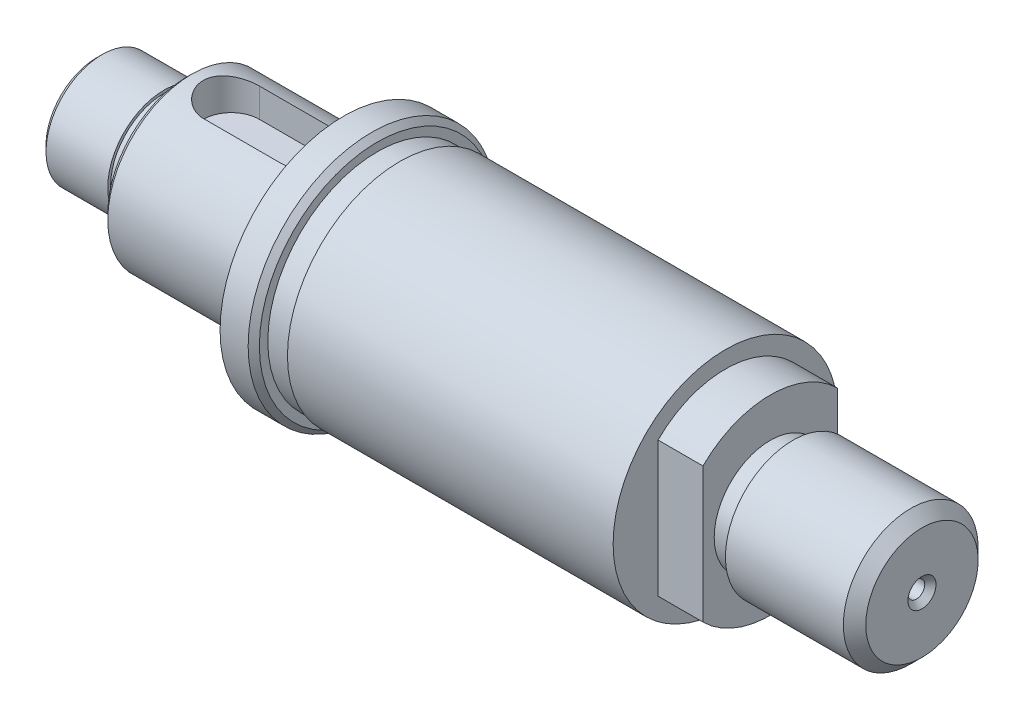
ISO-10303-21;
HEADER;
FILE_DESCRIPTION(('STEP AP214'),'2;1');
FILE_NAME('part.step','',(''),(''),'','','');
FILE_SCHEMA(('AUTOMOTIVE_DESIGN { 1 0 10303 214 1 1 1 1 }'));
ENDSEC;
DATA;
#1=APPLICATION_CONTEXT('core data for automotive mechanical design processes');
#2=APPLICATION_PROTOCOL_DEFINITION('international standard','automotive_design',2000,#1);
#3=PRODUCT_CONTEXT('',#1,'mechanical');
#4=PRODUCT('Part','Part','',(#3));
#5=PRODUCT_RELATED_PRODUCT_CATEGORY('part','',(#4));
#6=PRODUCT_DEFINITION_FORMATION('','',#4);
#7=PRODUCT_DEFINITION_CONTEXT('part definition',#1,'design');
#8=PRODUCT_DEFINITION('design','',#6,#7);
#9=PRODUCT_DEFINITION_SHAPE('','',#8);
#10=(LENGTH_UNIT() NAMED_UNIT(*) SI_UNIT(.MILLI.,.METRE.));
#11=(NAMED_UNIT(*) PLANE_ANGLE_UNIT() SI_UNIT($,.RADIAN.));
#12=(NAMED_UNIT(*) SI_UNIT($,.STERADIAN.) SOLID_ANGLE_UNIT());
#13=UNCERTAINTY_MEASURE_WITH_UNIT(LENGTH_MEASURE(1.E-05),#10,'distance_accuracy_value','');
#14=(GEOMETRIC_REPRESENTATION_CONTEXT(3) GLOBAL_UNCERTAINTY_ASSIGNED_CONTEXT((#13)) GLOBAL_UNIT_ASSIGNED_CONTEXT((#10,
#11,#12)) REPRESENTATION_CONTEXT('',''));
#15=CARTESIAN_POINT('',(0.,0.,0.));
#16=DIRECTION('',(0.,0.,1.));
#17=DIRECTION('',(1.,0.,0.));
#18=AXIS2_PLACEMENT_3D('',#15,#16,#17);
#19=CARTESIAN_POINT('',(0.,0.,0.));
#20=DIRECTION('',(-1.,0.,0.));
#21=DIRECTION('',(0.,0.,1.));
#22=AXIS2_PLACEMENT_3D('',#19,#20,#21);
#23=CYLINDRICAL_SURFACE('',#22,7.5);
#24=CARTESIAN_POINT('',(22.,0.,0.));
#25=DIRECTION('',(-1.,0.,0.));
#26=DIRECTION('',(0.,0.,1.));
#27=AXIS2_PLACEMENT_3D('',#24,#25,#26);
#28=CIRCLE('',#27,7.5);
#29=CARTESIAN_POINT('',(22.,0.,7.5));
#30=VERTEX_POINT('',#29);
#31=EDGE_CURVE('E198',#30,#30,#28,.T.);
#32=ORIENTED_EDGE('',*,*,#31,.T.);
#33=EDGE_LOOP('',(#32));
#34=FACE_BOUND('',#33,.T.);
#35=CARTESIAN_POINT('',(8.49999999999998,0.,0.));
#36=DIRECTION('',(1.,0.,0.));
#37=DIRECTION('',(0.,0.,-1.));
#38=AXIS2_PLACEMENT_3D('',#35,#36,#37);
#39=CIRCLE('',#38,7.5);
#40=CARTESIAN_POINT('',(8.49999999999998,0.,-7.5));
#41=VERTEX_POINT('',#40);
#42=EDGE_CURVE('E213',#41,#41,#39,.T.);
#43=ORIENTED_EDGE('',*,*,#42,.T.);
#44=EDGE_LOOP('',(#43));
#45=FACE_BOUND('',#44,.T.);
#46=CARTESIAN_POINT('',(19.,7.07106781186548,2.5));
#47=CARTESIAN_POINT('',(19.0682070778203,7.07105693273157,2.50000899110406));
#48=CARTESIAN_POINT('',(19.1364080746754,7.07205443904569,2.49720887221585));
#49=CARTESIAN_POINT('',(19.2722810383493,7.07598524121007,2.4860604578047));
#50=CARTESIAN_POINT('',(19.3399531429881,7.07891801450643,2.47771365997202));
#51=CARTESIAN_POINT('',(19.4740904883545,7.08662705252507,2.45557459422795));
#52=CARTESIAN_POINT('',(19.5405587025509,7.09139784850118,2.44179847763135));
#53=CARTESIAN_POINT('',(19.6720082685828,7.10262619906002,2.4089418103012));
#54=CARTESIAN_POINT('',(19.7369895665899,7.10908381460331,2.38986106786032));
#55=CARTESIAN_POINT('',(19.9289615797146,7.13069940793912,2.32491551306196));
#56=CARTESIAN_POINT('',(20.05317915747,7.14811243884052,2.2713141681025));
#57=CARTESIAN_POINT('',(20.2908768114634,7.1869703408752,2.14517784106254));
#58=CARTESIAN_POINT('',(20.4043502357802,7.20841768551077,2.07263123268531));
#59=CARTESIAN_POINT('',(20.6217929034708,7.25386182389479,1.90762995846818));
#60=CARTESIAN_POINT('',(20.7252851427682,7.27792189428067,1.81456284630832));
#61=CARTESIAN_POINT('',(20.9155171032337,7.32534626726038,1.61247071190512));
#62=CARTESIAN_POINT('',(21.002253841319,7.34871044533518,1.50344285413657));
#63=CARTESIAN_POINT('',(21.1586982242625,7.39284706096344,1.26900922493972));
#64=CARTESIAN_POINT('',(21.2279023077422,7.41353593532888,1.1432502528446));
#65=CARTESIAN_POINT('',(21.3439807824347,7.44924021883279,0.881073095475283));
#66=CARTESIAN_POINT('',(21.3908619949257,7.46425736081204,0.744658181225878));
#67=CARTESIAN_POINT('',(21.4593392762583,7.48647677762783,0.470073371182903));
#68=CARTESIAN_POINT('',(21.4817581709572,7.49393272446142,0.332129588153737));
#69=CARTESIAN_POINT('',(21.5032907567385,7.50109021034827,0.0542474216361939));
#70=CARTESIAN_POINT('',(21.5024100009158,7.50079359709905,-0.0856904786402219));
#71=CARTESIAN_POINT('',(21.4778892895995,7.49265096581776,-0.35775961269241));
#72=CARTESIAN_POINT('',(21.4551434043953,7.48510152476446,-0.489981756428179));
#73=CARTESIAN_POINT('',(21.3890170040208,7.46367401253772,-0.748610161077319));
#74=CARTESIAN_POINT('',(21.3456353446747,7.44979559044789,-0.875016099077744));
#75=CARTESIAN_POINT('',(21.2389465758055,7.41689170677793,-1.12038155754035));
#76=CARTESIAN_POINT('',(21.1753848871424,7.39780094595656,-1.23922126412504));
#77=CARTESIAN_POINT('',(21.030350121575,7.35645969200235,-1.46481147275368));
#78=CARTESIAN_POINT('',(20.9488721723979,7.33420833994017,-1.57155867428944));
#79=CARTESIAN_POINT('',(20.765822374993,7.28765679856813,-1.77524334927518));
#80=CARTESIAN_POINT('',(20.6634861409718,7.26330946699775,-1.87148402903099));
#81=CARTESIAN_POINT('',(20.4438962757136,7.21618726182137,-2.04568006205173));
#82=CARTESIAN_POINT('',(20.326637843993,7.19341289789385,-2.12362950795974));
#83=CARTESIAN_POINT('',(20.0782995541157,7.15175078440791,-2.26000831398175));
#84=CARTESIAN_POINT('',(19.9470412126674,7.13292537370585,-2.31813252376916));
#85=CARTESIAN_POINT('',(19.6758825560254,7.10202742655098,-2.41115057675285));
#86=CARTESIAN_POINT('',(19.5359962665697,7.08994423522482,-2.44608109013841));
#87=CARTESIAN_POINT('',(19.32895340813,7.078413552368,-2.47914539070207));
#88=CARTESIAN_POINT('',(19.2633965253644,7.07566669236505,-2.48696265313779));
#89=CARTESIAN_POINT('',(19.1319048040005,7.07199258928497,-2.497386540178));
#90=CARTESIAN_POINT('',(19.065970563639,7.0710629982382,-2.49999988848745));
#91=CARTESIAN_POINT('',(19.,7.07106781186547,-2.5));
#92=B_SPLINE_CURVE_WITH_KNOTS('',3,(#46,#47,#48,#49,#50,#51,#52,#53,#54,#55,#56,#57,#58,#59,#60,
#61,#62,#63,#64,#65,#66,#67,#68,#69,#70,#71,#72,#73,#74,#75,#76,#77,#78,#79,#80,#81,#82,#83,#84,
#85,#86,#87,#88,#89,#90,#91),.UNSPECIFIED.,.F.,.F.,(4,2,2,2,2,2,2,2,2,2,2,2,2,2,2,2,2,2,2,2,2,2,
4),(0.,0.204546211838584,0.409037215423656,0.612924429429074,0.816819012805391,1.22401016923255,
1.63145179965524,2.0532786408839,2.47518051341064,2.90809434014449,3.34087579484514,
3.75860278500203,4.17623021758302,4.57747647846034,4.97874498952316,5.38529148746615,
5.79194868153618,6.21771736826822,6.64362337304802,7.07581676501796,7.50732520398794,
7.70536340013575,7.90314555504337),.UNSPECIFIED.);
#93=CARTESIAN_POINT('',(19.,7.07106781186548,2.5));
#94=VERTEX_POINT('',#93);
#95=CARTESIAN_POINT('',(19.,7.07106781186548,-2.5));
#96=VERTEX_POINT('',#95);
#97=EDGE_CURVE('E11',#94,#96,#92,.T.);
#98=ORIENTED_EDGE('',*,*,#97,.F.);
#99=DIRECTION('',(-1.,0.,0.));
#100=VECTOR('',#99,1.);
#101=CARTESIAN_POINT('',(0.,7.07106781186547,2.5));
#102=LINE('',#101,#100);
#103=CARTESIAN_POINT('',(12.,7.07106781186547,2.5));
#104=VERTEX_POINT('',#103);
#105=EDGE_CURVE('E254',#104,#94,#102,.F.);
#106=ORIENTED_EDGE('',*,*,#105,.F.);
#107=CARTESIAN_POINT('',(12.,7.07106781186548,-2.5));
#108=CARTESIAN_POINT('',(11.9317929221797,7.07105693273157,-2.50000899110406));
#109=CARTESIAN_POINT('',(11.8635919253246,7.07205443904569,-2.49720887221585));
#110=CARTESIAN_POINT('',(11.7277189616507,7.07598524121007,-2.48606045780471));
#111=CARTESIAN_POINT('',(11.6600468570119,7.07891801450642,-2.47771365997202));
#112=CARTESIAN_POINT('',(11.5259095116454,7.08662705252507,-2.45557459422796));
#113=CARTESIAN_POINT('',(11.4594412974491,7.09139784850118,-2.44179847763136));
#114=CARTESIAN_POINT('',(11.3279917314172,7.10262619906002,-2.40894181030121));
#115=CARTESIAN_POINT('',(11.2630104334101,7.10908381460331,-2.38986106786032));
#116=CARTESIAN_POINT('',(11.0710384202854,7.13069940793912,-2.32491551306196));
#117=CARTESIAN_POINT('',(10.94682084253,7.14811243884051,-2.2713141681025));
#118=CARTESIAN_POINT('',(10.7091231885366,7.1869703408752,-2.14517784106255));
#119=CARTESIAN_POINT('',(10.5956497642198,7.20841768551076,-2.07263123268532));
#120=CARTESIAN_POINT('',(10.3782070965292,7.25386182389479,-1.90762995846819));
#121=CARTESIAN_POINT('',(10.2747148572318,7.27792189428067,-1.81456284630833));
#122=CARTESIAN_POINT('',(10.0844828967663,7.32534626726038,-1.61247071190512));
#123=CARTESIAN_POINT('',(9.997746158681,7.34871044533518,-1.50344285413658));
#124=CARTESIAN_POINT('',(9.84130177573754,7.39284706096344,-1.26900922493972));
#125=CARTESIAN_POINT('',(9.77209769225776,7.41353593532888,-1.14325025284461));
#126=CARTESIAN_POINT('',(9.6560192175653,7.44924021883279,-0.881073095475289));
#127=CARTESIAN_POINT('',(9.60913800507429,7.46425736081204,-0.744658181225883));
#128=CARTESIAN_POINT('',(9.54066072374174,7.48647677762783,-0.470073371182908));
#129=CARTESIAN_POINT('',(9.51824182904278,7.49393272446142,-0.332129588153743));
#130=CARTESIAN_POINT('',(9.49670924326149,7.50109021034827,-0.0542474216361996));
#131=CARTESIAN_POINT('',(9.49758999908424,7.50079359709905,0.0856904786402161));
#132=CARTESIAN_POINT('',(9.52211071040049,7.49265096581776,0.357759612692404));
#133=CARTESIAN_POINT('',(9.54485659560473,7.48510152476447,0.489981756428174));
#134=CARTESIAN_POINT('',(9.61098299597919,7.46367401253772,0.748610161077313));
#135=CARTESIAN_POINT('',(9.65436465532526,7.44979559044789,0.875016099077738));
#136=CARTESIAN_POINT('',(9.76105342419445,7.41689170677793,1.12038155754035));
#137=CARTESIAN_POINT('',(9.82461511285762,7.39780094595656,1.23922126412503));
#138=CARTESIAN_POINT('',(9.96964987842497,7.35645969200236,1.46481147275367));
#139=CARTESIAN_POINT('',(10.0511278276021,7.33420833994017,1.57155867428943));
#140=CARTESIAN_POINT('',(10.2341776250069,7.28765679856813,1.77524334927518));
#141=CARTESIAN_POINT('',(10.3365138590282,7.26330946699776,1.87148402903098));
#142=CARTESIAN_POINT('',(10.5561037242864,7.21618726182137,2.04568006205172));
#143=CARTESIAN_POINT('',(10.673362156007,7.19341289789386,2.12362950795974));
#144=CARTESIAN_POINT('',(10.9217004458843,7.15175078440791,2.26000831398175));
#145=CARTESIAN_POINT('',(11.0529587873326,7.13292537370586,2.31813252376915));
#146=CARTESIAN_POINT('',(11.3241174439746,7.10202742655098,2.41115057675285));
#147=CARTESIAN_POINT('',(11.4640037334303,7.08994423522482,2.4460810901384));
#148=CARTESIAN_POINT('',(11.67104659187,7.078413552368,2.47914539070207));
#149=CARTESIAN_POINT('',(11.7366034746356,7.07566669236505,2.48696265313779));
#150=CARTESIAN_POINT('',(11.8680951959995,7.07199258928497,2.497386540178));
#151=CARTESIAN_POINT('',(11.934029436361,7.0710629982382,2.49999988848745));
#152=CARTESIAN_POINT('',(12.,7.07106781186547,2.5));
#153=B_SPLINE_CURVE_WITH_KNOTS('',3,(#107,#108,#109,#110,#111,#112,#113,#114,#115,#116,#117,
#118,#119,#120,#121,#122,#123,#124,#125,#126,#127,#128,#129,#130,#131,#132,#133,#134,#135,#136,
#137,#138,#139,#140,#141,#142,#143,#144,#145,#146,#147,#148,#149,#150,#151,#152),.UNSPECIFIED.,
.F.,.F.,(4,2,2,2,2,2,2,2,2,2,2,2,2,2,2,2,2,2,2,2,2,2,4),(0.,0.204546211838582,0.409037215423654,
0.612924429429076,0.816819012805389,1.22401016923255,1.63145179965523,2.0532786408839,
2.47518051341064,2.90809434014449,3.34087579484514,3.75860278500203,4.17623021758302,
4.57747647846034,4.97874498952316,5.38529148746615,5.79194868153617,6.21771736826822,
6.64362337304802,7.07581676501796,7.50732520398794,7.70536340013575,7.90314555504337),.UNSPECIFIED.);
#154=CARTESIAN_POINT('',(12.,7.07106781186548,-2.5));
#155=VERTEX_POINT('',#154);
#156=EDGE_CURVE('E256',#155,#104,#153,.T.);
#157=ORIENTED_EDGE('',*,*,#156,.F.);
#158=DIRECTION('',(-1.,0.,0.));
#159=VECTOR('',#158,1.);
#160=CARTESIAN_POINT('',(0.,7.07106781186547,-2.5));
#161=LINE('',#160,#159);
#162=EDGE_CURVE('E50',#96,#155,#161,.T.);
#163=ORIENTED_EDGE('',*,*,#162,.F.);
#164=EDGE_LOOP('',(#98,#106,#157,#163));
#165=FACE_BOUND('',#164,.T.);
#166=ADVANCED_FACE('F37',(#34,#45,#165),#23,.T.);
#167=CARTESIAN_POINT('',(0.,0.,0.));
#168=DIRECTION('',(-1.,0.,0.));
#169=DIRECTION('',(0.,0.,1.));
#170=AXIS2_PLACEMENT_3D('',#167,#168,#169);
#171=CYLINDRICAL_SURFACE('',#170,8.5);
#172=CARTESIAN_POINT('',(60.,0.,0.));
#173=DIRECTION('',(-1.,0.,0.));
#174=DIRECTION('',(0.,0.,1.));
#175=AXIS2_PLACEMENT_3D('',#172,#173,#174);
#176=CIRCLE('',#175,8.5);
#177=CARTESIAN_POINT('',(60.,6.02079728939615,6.));
#178=VERTEX_POINT('',#177);
#179=CARTESIAN_POINT('',(60.,6.02079728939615,-6.));
#180=VERTEX_POINT('',#179);
#181=EDGE_CURVE('E175',#178,#180,#176,.T.);
#182=ORIENTED_EDGE('',*,*,#181,.T.);
#183=DIRECTION('',(-1.,0.,0.));
#184=VECTOR('',#183,1.);
#185=CARTESIAN_POINT('',(0.,6.02079728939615,-6.));
#186=LINE('',#185,#184);
#187=CARTESIAN_POINT('',(56.,6.02079728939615,-6.));
#188=VERTEX_POINT('',#187);
#189=EDGE_CURVE('E65',#180,#188,#186,.T.);
#190=ORIENTED_EDGE('',*,*,#189,.T.);
#191=CARTESIAN_POINT('',(56.,0.,0.));
#192=DIRECTION('',(-1.,0.,0.));
#193=DIRECTION('',(0.,0.,1.));
#194=AXIS2_PLACEMENT_3D('',#191,#192,#193);
#195=CIRCLE('',#194,8.5);
#196=CARTESIAN_POINT('',(56.,6.02079728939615,6.));
#197=VERTEX_POINT('',#196);
#198=EDGE_CURVE('E179',#197,#188,#195,.T.);
#199=ORIENTED_EDGE('',*,*,#198,.F.);
#200=DIRECTION('',(-1.,0.,0.));
#201=VECTOR('',#200,1.);
#202=CARTESIAN_POINT('',(0.,6.02079728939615,6.));
#203=LINE('',#202,#201);
#204=EDGE_CURVE('E159',#197,#178,#203,.F.);
#205=ORIENTED_EDGE('',*,*,#204,.T.);
#206=EDGE_LOOP('',(#182,#190,#199,#205));
#207=FACE_BOUND('',#206,.T.);
#208=ADVANCED_FACE('F352',(#207),#171,.T.);
#209=CARTESIAN_POINT('',(0.,0.,0.));
#210=DIRECTION('',(1.,0.,0.));
#211=DIRECTION('',(0.,0.,-1.));
#212=AXIS2_PLACEMENT_3D('',#209,#210,#211);
#213=PLANE('',#212);
#214=CARTESIAN_POINT('',(0.,0.,0.));
#215=DIRECTION('',(1.,0.,0.));
#216=DIRECTION('',(0.,0.,-1.));
#217=AXIS2_PLACEMENT_3D('',#214,#215,#216);
#218=CIRCLE('',#217,1.24999999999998);
#219=CARTESIAN_POINT('',(0.,0.,-1.24999999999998));
#220=VERTEX_POINT('',#219);
#221=EDGE_CURVE('E251',#220,#220,#218,.T.);
#222=ORIENTED_EDGE('',*,*,#221,.T.);
#223=EDGE_LOOP('',(#222));
#224=FACE_BOUND('',#223,.T.);
#225=CARTESIAN_POINT('',(0.,0.,0.));
#226=DIRECTION('',(1.,0.,0.));
#227=DIRECTION('',(0.,0.,-1.));
#228=AXIS2_PLACEMENT_3D('',#225,#226,#227);
#229=CIRCLE('',#228,4.50000000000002);
#230=CARTESIAN_POINT('',(0.,0.,-4.50000000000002));
#231=VERTEX_POINT('',#230);
#232=EDGE_CURVE('E219',#231,#231,#229,.F.);
#233=ORIENTED_EDGE('',*,*,#232,.T.);
#234=EDGE_LOOP('',(#233));
#235=FACE_BOUND('',#234,.T.);
#236=ADVANCED_FACE('F39',(#224,#235),#213,.F.);
#237=CARTESIAN_POINT('',(0.,0.,0.));
#238=DIRECTION('',(-1.,0.,0.));
#239=DIRECTION('',(0.,0.,1.));
#240=AXIS2_PLACEMENT_3D('',#237,#238,#239);
#241=CYLINDRICAL_SURFACE('',#240,5.);
#242=CARTESIAN_POINT('',(0.499999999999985,0.,0.));
#243=DIRECTION('',(1.,0.,0.));
#244=DIRECTION('',(0.,0.,-1.));
#245=AXIS2_PLACEMENT_3D('',#242,#243,#244);
#246=CIRCLE('',#245,5.);
#247=CARTESIAN_POINT('',(0.499999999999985,0.,-5.));
#248=VERTEX_POINT('',#247);
#249=EDGE_CURVE('E222',#248,#248,#246,.T.);
#250=ORIENTED_EDGE('',*,*,#249,.T.);
#251=EDGE_LOOP('',(#250));
#252=FACE_BOUND('',#251,.T.);
#253=CARTESIAN_POINT('',(6.,0.,0.));
#254=DIRECTION('',(-1.,0.,0.));
#255=DIRECTION('',(0.,0.,1.));
#256=AXIS2_PLACEMENT_3D('',#253,#254,#255);
#257=CIRCLE('',#256,5.);
#258=CARTESIAN_POINT('',(6.,0.,5.));
#259=VERTEX_POINT('',#258);
#260=EDGE_CURVE('E204',#259,#259,#257,.T.);
#261=ORIENTED_EDGE('',*,*,#260,.T.);
#262=EDGE_LOOP('',(#261));
#263=FACE_BOUND('',#262,.T.);
#264=ADVANCED_FACE('F431',(#252,#263),#241,.T.);
#265=CARTESIAN_POINT('',(6.,5.,0.));
#266=DIRECTION('',(-1.,0.,0.));
#267=DIRECTION('',(0.,0.,1.));
#268=AXIS2_PLACEMENT_3D('',#265,#266,#267);
#269=PLANE('',#268);
#270=ORIENTED_EDGE('',*,*,#260,.F.);
#271=EDGE_LOOP('',(#270));
#272=FACE_BOUND('',#271,.T.);
#273=CARTESIAN_POINT('',(6.,0.,0.));
#274=DIRECTION('',(-1.,0.,0.));
#275=DIRECTION('',(0.,0.,1.));
#276=AXIS2_PLACEMENT_3D('',#273,#274,#275);
#277=CIRCLE('',#276,4.75);
#278=CARTESIAN_POINT('',(6.,0.,4.75));
#279=VERTEX_POINT('',#278);
#280=EDGE_CURVE('E201',#279,#279,#277,.T.);
#281=ORIENTED_EDGE('',*,*,#280,.T.);
#282=EDGE_LOOP('',(#281));
#283=FACE_BOUND('',#282,.T.);
#284=ADVANCED_FACE('F436',(#272,#283),#269,.F.);
#285=CARTESIAN_POINT('',(0.,0.,0.));
#286=DIRECTION('',(-1.,0.,0.));
#287=DIRECTION('',(0.,0.,1.));
#288=AXIS2_PLACEMENT_3D('',#285,#286,#287);
#289=CYLINDRICAL_SURFACE('',#288,4.75);
#290=CARTESIAN_POINT('',(7.50000000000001,0.,0.));
#291=DIRECTION('',(1.,0.,0.));
#292=DIRECTION('',(0.,0.,-1.));
#293=AXIS2_PLACEMENT_3D('',#290,#291,#292);
#294=CIRCLE('',#293,4.75);
#295=CARTESIAN_POINT('',(7.50000000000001,0.,-4.75));
#296=VERTEX_POINT('',#295);
#297=EDGE_CURVE('E216',#296,#296,#294,.F.);
#298=ORIENTED_EDGE('',*,*,#297,.T.);
#299=EDGE_LOOP('',(#298));
#300=FACE_BOUND('',#299,.T.);
#301=ORIENTED_EDGE('',*,*,#280,.F.);
#302=EDGE_LOOP('',(#301));
#303=FACE_BOUND('',#302,.T.);
#304=ADVANCED_FACE('F382',(#300,#303),#289,.T.);
#305=CARTESIAN_POINT('',(8.,4.75,0.));
#306=DIRECTION('',(1.,0.,0.));
#307=DIRECTION('',(0.,0.,-1.));
#308=AXIS2_PLACEMENT_3D('',#305,#306,#307);
#309=PLANE('',#308);
#310=CARTESIAN_POINT('',(8.,0.,0.));
#311=DIRECTION('',(1.,0.,0.));
#312=DIRECTION('',(0.,0.,-1.));
#313=AXIS2_PLACEMENT_3D('',#310,#311,#312);
#314=CIRCLE('',#313,7.00000000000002);
#315=CARTESIAN_POINT('',(8.,0.,-7.00000000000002));
#316=VERTEX_POINT('',#315);
#317=EDGE_CURVE('E210',#316,#316,#314,.F.);
#318=ORIENTED_EDGE('',*,*,#317,.T.);
#319=EDGE_LOOP('',(#318));
#320=FACE_BOUND('',#319,.T.);
#321=CARTESIAN_POINT('',(8.,0.,0.));
#322=DIRECTION('',(1.,0.,0.));
#323=DIRECTION('',(0.,0.,-1.));
#324=AXIS2_PLACEMENT_3D('',#321,#322,#323);
#325=CIRCLE('',#324,5.24999999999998);
#326=CARTESIAN_POINT('',(8.,0.,-5.24999999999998));
#327=VERTEX_POINT('',#326);
#328=EDGE_CURVE('E207',#327,#327,#325,.T.);
#329=ORIENTED_EDGE('',*,*,#328,.T.);
#330=EDGE_LOOP('',(#329));
#331=FACE_BOUND('',#330,.T.);
#332=ADVANCED_FACE('F377',(#320,#331),#309,.F.);
#333=CARTESIAN_POINT('',(22.,7.5,0.));
#334=DIRECTION('',(1.,0.,0.));
#335=DIRECTION('',(0.,0.,-1.));
#336=AXIS2_PLACEMENT_3D('',#333,#334,#335);
#337=PLANE('',#336);
#338=ORIENTED_EDGE('',*,*,#31,.F.);
#339=EDGE_LOOP('',(#338));
#340=FACE_BOUND('',#339,.T.);
#341=CARTESIAN_POINT('',(22.,0.,0.));
#342=DIRECTION('',(-1.,0.,0.));
#343=DIRECTION('',(0.,0.,1.));
#344=AXIS2_PLACEMENT_3D('',#341,#342,#343);
#345=CIRCLE('',#344,11.);
#346=CARTESIAN_POINT('',(22.,0.,11.));
#347=VERTEX_POINT('',#346);
#348=EDGE_CURVE('E195',#347,#347,#345,.T.);
#349=ORIENTED_EDGE('',*,*,#348,.T.);
#350=EDGE_LOOP('',(#349));
#351=FACE_BOUND('',#350,.T.);
#352=ADVANCED_FACE('F374',(#340,#351),#337,.F.);
#353=CARTESIAN_POINT('',(0.,0.,0.));
#354=DIRECTION('',(-1.,0.,0.));
#355=DIRECTION('',(0.,0.,1.));
#356=AXIS2_PLACEMENT_3D('',#353,#354,#355);
#357=CYLINDRICAL_SURFACE('',#356,11.);
#358=CARTESIAN_POINT('',(24.5,0.,0.));
#359=DIRECTION('',(-1.,0.,0.));
#360=DIRECTION('',(0.,0.,1.));
#361=AXIS2_PLACEMENT_3D('',#358,#359,#360);
#362=CIRCLE('',#361,11.);
#363=CARTESIAN_POINT('',(24.5,0.,11.));
#364=VERTEX_POINT('',#363);
#365=EDGE_CURVE('E225',#364,#364,#362,.T.);
#366=ORIENTED_EDGE('',*,*,#365,.T.);
#367=EDGE_LOOP('',(#366));
#368=FACE_BOUND('',#367,.T.);
#369=ORIENTED_EDGE('',*,*,#348,.F.);
#370=EDGE_LOOP('',(#369));
#371=FACE_BOUND('',#370,.T.);
#372=ADVANCED_FACE('F371',(#368,#371),#357,.T.);
#373=CARTESIAN_POINT('',(25.,11.,0.));
#374=DIRECTION('',(-1.,0.,0.));
#375=DIRECTION('',(0.,0.,1.));
#376=AXIS2_PLACEMENT_3D('',#373,#374,#375);
#377=PLANE('',#376);
#378=CARTESIAN_POINT('',(25.,0.,0.));
#379=DIRECTION('',(-1.,0.,0.));
#380=DIRECTION('',(0.,0.,1.));
#381=AXIS2_PLACEMENT_3D('',#378,#379,#380);
#382=CIRCLE('',#381,10.5);
#383=CARTESIAN_POINT('',(25.,0.,10.5));
#384=VERTEX_POINT('',#383);
#385=EDGE_CURVE('E228',#384,#384,#382,.F.);
#386=ORIENTED_EDGE('',*,*,#385,.T.);
#387=EDGE_LOOP('',(#386));
#388=FACE_BOUND('',#387,.T.);
#389=CARTESIAN_POINT('',(25.,0.,0.));
#390=DIRECTION('',(-1.,0.,0.));
#391=DIRECTION('',(0.,0.,1.));
#392=AXIS2_PLACEMENT_3D('',#389,#390,#391);
#393=CIRCLE('',#392,9.75);
#394=CARTESIAN_POINT('',(25.,0.,9.75));
#395=VERTEX_POINT('',#394);
#396=EDGE_CURVE('E192',#395,#395,#393,.T.);
#397=ORIENTED_EDGE('',*,*,#396,.T.);
#398=EDGE_LOOP('',(#397));
#399=FACE_BOUND('',#398,.T.);
#400=ADVANCED_FACE('F367',(#388,#399),#377,.F.);
#401=CARTESIAN_POINT('',(0.,0.,0.));
#402=DIRECTION('',(-1.,0.,0.));
#403=DIRECTION('',(0.,0.,1.));
#404=AXIS2_PLACEMENT_3D('',#401,#402,#403);
#405=CYLINDRICAL_SURFACE('',#404,9.75);
#406=ORIENTED_EDGE('',*,*,#396,.F.);
#407=EDGE_LOOP('',(#406));
#408=FACE_BOUND('',#407,.T.);
#409=CARTESIAN_POINT('',(27.,0.,0.));
#410=DIRECTION('',(-1.,0.,0.));
#411=DIRECTION('',(0.,0.,1.));
#412=AXIS2_PLACEMENT_3D('',#409,#410,#411);
#413=CIRCLE('',#412,9.75);
#414=CARTESIAN_POINT('',(27.,0.,9.75));
#415=VERTEX_POINT('',#414);
#416=EDGE_CURVE('E189',#415,#415,#413,.T.);
#417=ORIENTED_EDGE('',*,*,#416,.T.);
#418=EDGE_LOOP('',(#417));
#419=FACE_BOUND('',#418,.T.);
#420=ADVANCED_FACE('F363',(#408,#419),#405,.T.);
#421=CARTESIAN_POINT('',(27.,9.75,0.));
#422=DIRECTION('',(1.,0.,0.));
#423=DIRECTION('',(0.,0.,-1.));
#424=AXIS2_PLACEMENT_3D('',#421,#422,#423);
#425=PLANE('',#424);
#426=ORIENTED_EDGE('',*,*,#416,.F.);
#427=EDGE_LOOP('',(#426));
#428=FACE_BOUND('',#427,.T.);
#429=CARTESIAN_POINT('',(27.,0.,0.));
#430=DIRECTION('',(-1.,0.,0.));
#431=DIRECTION('',(0.,0.,1.));
#432=AXIS2_PLACEMENT_3D('',#429,#430,#431);
#433=CIRCLE('',#432,10.);
#434=CARTESIAN_POINT('',(27.,0.,10.));
#435=VERTEX_POINT('',#434);
#436=EDGE_CURVE('E186',#435,#435,#433,.T.);
#437=ORIENTED_EDGE('',*,*,#436,.T.);
#438=EDGE_LOOP('',(#437));
#439=FACE_BOUND('',#438,.T.);
#440=ADVANCED_FACE('F359',(#428,#439),#425,.F.);
#441=CARTESIAN_POINT('',(0.,0.,0.));
#442=DIRECTION('',(-1.,0.,0.));
#443=DIRECTION('',(0.,0.,1.));
#444=AXIS2_PLACEMENT_3D('',#441,#442,#443);
#445=CYLINDRICAL_SURFACE('',#444,10.);
#446=ORIENTED_EDGE('',*,*,#436,.F.);
#447=EDGE_LOOP('',(#446));
#448=FACE_BOUND('',#447,.T.);
#449=CARTESIAN_POINT('',(56.,0.,0.));
#450=DIRECTION('',(-1.,0.,0.));
#451=DIRECTION('',(0.,0.,1.));
#452=AXIS2_PLACEMENT_3D('',#449,#450,#451);
#453=CIRCLE('',#452,10.);
#454=CARTESIAN_POINT('',(56.,0.,10.));
#455=VERTEX_POINT('',#454);
#456=EDGE_CURVE('E182',#455,#455,#453,.T.);
#457=ORIENTED_EDGE('',*,*,#456,.T.);
#458=EDGE_LOOP('',(#457));
#459=FACE_BOUND('',#458,.T.);
#460=ADVANCED_FACE('F355',(#448,#459),#445,.T.);
#461=CARTESIAN_POINT('',(56.,10.,0.));
#462=DIRECTION('',(-1.,0.,0.));
#463=DIRECTION('',(0.,0.,1.));
#464=AXIS2_PLACEMENT_3D('',#461,#462,#463);
#465=PLANE('',#464);
#466=DIRECTION('',(0.,-1.,0.));
#467=VECTOR('',#466,1.);
#468=CARTESIAN_POINT('',(56.,12.5735252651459,-6.));
#469=LINE('',#468,#467);
#470=CARTESIAN_POINT('',(56.,-6.02079728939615,-6.));
#471=VERTEX_POINT('',#470);
#472=EDGE_CURVE('E149',#188,#471,#469,.T.);
#473=ORIENTED_EDGE('',*,*,#472,.T.);
#474=CARTESIAN_POINT('',(56.,-6.02079728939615,6.));
#475=VERTEX_POINT('',#474);
#476=EDGE_CURVE('E178',#471,#475,#195,.T.);
#477=ORIENTED_EDGE('',*,*,#476,.T.);
#478=DIRECTION('',(0.,1.,0.));
#479=VECTOR('',#478,1.);
#480=CARTESIAN_POINT('',(56.,12.5735252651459,6.));
#481=LINE('',#480,#479);
#482=EDGE_CURVE('E156',#475,#197,#481,.T.);
#483=ORIENTED_EDGE('',*,*,#482,.T.);
#484=ORIENTED_EDGE('',*,*,#198,.T.);
#485=EDGE_LOOP('',(#473,#477,#483,#484));
#486=FACE_BOUND('',#485,.T.);
#487=ORIENTED_EDGE('',*,*,#456,.F.);
#488=EDGE_LOOP('',(#487));
#489=FACE_BOUND('',#488,.T.);
#490=ADVANCED_FACE('F350',(#486,#489),#465,.F.);
#491=ORIENTED_EDGE('',*,*,#476,.F.);
#492=DIRECTION('',(-1.,0.,0.));
#493=VECTOR('',#492,1.);
#494=CARTESIAN_POINT('',(0.,-6.02079728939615,-6.));
#495=LINE('',#494,#493);
#496=CARTESIAN_POINT('',(60.,-6.02079728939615,-6.));
#497=VERTEX_POINT('',#496);
#498=EDGE_CURVE('E152',#471,#497,#495,.F.);
#499=ORIENTED_EDGE('',*,*,#498,.T.);
#500=CARTESIAN_POINT('',(60.,-6.02079728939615,6.));
#501=VERTEX_POINT('',#500);
#502=EDGE_CURVE('E174',#497,#501,#176,.T.);
#503=ORIENTED_EDGE('',*,*,#502,.T.);
#504=DIRECTION('',(-1.,0.,0.));
#505=VECTOR('',#504,1.);
#506=CARTESIAN_POINT('',(0.,-6.02079728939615,6.));
#507=LINE('',#506,#505);
#508=EDGE_CURVE('E162',#501,#475,#507,.T.);
#509=ORIENTED_EDGE('',*,*,#508,.T.);
#510=EDGE_LOOP('',(#491,#499,#503,#509));
#511=FACE_BOUND('',#510,.T.);
#512=ADVANCED_FACE('F346',(#511),#171,.T.);
#513=CARTESIAN_POINT('',(60.,8.5,0.));
#514=DIRECTION('',(-1.,0.,0.));
#515=DIRECTION('',(0.,0.,1.));
#516=AXIS2_PLACEMENT_3D('',#513,#514,#515);
#517=PLANE('',#516);
#518=ORIENTED_EDGE('',*,*,#502,.F.);
#519=DIRECTION('',(0.,1.,0.));
#520=VECTOR('',#519,1.);
#521=CARTESIAN_POINT('',(60.,8.5,-6.));
#522=LINE('',#521,#520);
#523=EDGE_CURVE('E234',#497,#180,#522,.T.);
#524=ORIENTED_EDGE('',*,*,#523,.T.);
#525=ORIENTED_EDGE('',*,*,#181,.F.);
#526=DIRECTION('',(0.,-1.,0.));
#527=VECTOR('',#526,1.);
#528=CARTESIAN_POINT('',(60.,8.5,6.));
#529=LINE('',#528,#527);
#530=EDGE_CURVE('E231',#178,#501,#529,.T.);
#531=ORIENTED_EDGE('',*,*,#530,.T.);
#532=EDGE_LOOP('',(#518,#524,#525,#531));
#533=FACE_BOUND('',#532,.T.);
#534=CARTESIAN_POINT('',(60.,0.,0.));
#535=DIRECTION('',(-1.,0.,0.));
#536=DIRECTION('',(0.,0.,1.));
#537=AXIS2_PLACEMENT_3D('',#534,#535,#536);
#538=CIRCLE('',#537,5.);
#539=CARTESIAN_POINT('',(60.,0.,5.));
#540=VERTEX_POINT('',#539);
#541=EDGE_CURVE('E171',#540,#540,#538,.T.);
#542=ORIENTED_EDGE('',*,*,#541,.T.);
#543=EDGE_LOOP('',(#542));
#544=FACE_BOUND('',#543,.T.);
#545=ADVANCED_FACE('F342',(#533,#544),#517,.F.);
#546=CARTESIAN_POINT('',(0.,0.,0.));
#547=DIRECTION('',(-1.,0.,0.));
#548=DIRECTION('',(0.,0.,1.));
#549=AXIS2_PLACEMENT_3D('',#546,#547,#548);
#550=CYLINDRICAL_SURFACE('',#549,5.);
#551=ORIENTED_EDGE('',*,*,#541,.F.);
#552=EDGE_LOOP('',(#551));
#553=FACE_BOUND('',#552,.T.);
#554=CARTESIAN_POINT('',(62.,0.,0.));
#555=DIRECTION('',(-1.,0.,0.));
#556=DIRECTION('',(0.,0.,1.));
#557=AXIS2_PLACEMENT_3D('',#554,#555,#556);
#558=CIRCLE('',#557,5.);
#559=CARTESIAN_POINT('',(62.,0.,5.));
#560=VERTEX_POINT('',#559);
#561=EDGE_CURVE('E168',#560,#560,#558,.T.);
#562=ORIENTED_EDGE('',*,*,#561,.T.);
#563=EDGE_LOOP('',(#562));
#564=FACE_BOUND('',#563,.T.);
#565=ADVANCED_FACE('F338',(#553,#564),#550,.T.);
#566=CARTESIAN_POINT('',(62.,5.,0.));
#567=DIRECTION('',(1.,0.,0.));
#568=DIRECTION('',(0.,0.,-1.));
#569=AXIS2_PLACEMENT_3D('',#566,#567,#568);
#570=PLANE('',#569);
#571=ORIENTED_EDGE('',*,*,#561,.F.);
#572=EDGE_LOOP('',(#571));
#573=FACE_BOUND('',#572,.T.);
#574=CARTESIAN_POINT('',(62.,0.,0.));
#575=DIRECTION('',(-1.,0.,0.));
#576=DIRECTION('',(0.,0.,1.));
#577=AXIS2_PLACEMENT_3D('',#574,#575,#576);
#578=CIRCLE('',#577,6.);
#579=CARTESIAN_POINT('',(62.,0.,6.));
#580=VERTEX_POINT('',#579);
#581=EDGE_CURVE('E165',#580,#580,#578,.T.);
#582=ORIENTED_EDGE('',*,*,#581,.T.);
#583=EDGE_LOOP('',(#582));
#584=FACE_BOUND('',#583,.T.);
#585=ADVANCED_FACE('F334',(#573,#584),#570,.F.);
#586=CARTESIAN_POINT('',(0.,0.,0.));
#587=DIRECTION('',(-1.,0.,0.));
#588=DIRECTION('',(0.,0.,1.));
#589=AXIS2_PLACEMENT_3D('',#586,#587,#588);
#590=CYLINDRICAL_SURFACE('',#589,6.);
#591=CARTESIAN_POINT('',(72.5,0.,0.));
#592=DIRECTION('',(-1.,0.,0.));
#593=DIRECTION('',(0.,0.,1.));
#594=AXIS2_PLACEMENT_3D('',#591,#592,#593);
#595=CIRCLE('',#594,6.);
#596=CARTESIAN_POINT('',(72.5,0.,6.));
#597=VERTEX_POINT('',#596);
#598=EDGE_CURVE('E236',#597,#597,#595,.T.);
#599=ORIENTED_EDGE('',*,*,#598,.T.);
#600=EDGE_LOOP('',(#599));
#601=FACE_BOUND('',#600,.T.);
#602=ORIENTED_EDGE('',*,*,#581,.F.);
#603=EDGE_LOOP('',(#602));
#604=FACE_BOUND('',#603,.T.);
#605=ADVANCED_FACE('F330',(#601,#604),#590,.T.);
#606=CARTESIAN_POINT('',(73.5,6.,0.));
#607=DIRECTION('',(-1.,0.,0.));
#608=DIRECTION('',(0.,0.,1.));
#609=AXIS2_PLACEMENT_3D('',#606,#607,#608);
#610=PLANE('',#609);
#611=CARTESIAN_POINT('',(73.5,0.,0.));
#612=DIRECTION('',(-1.,0.,0.));
#613=DIRECTION('',(0.,0.,1.));
#614=AXIS2_PLACEMENT_3D('',#611,#612,#613);
#615=CIRCLE('',#614,1.25000000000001);
#616=CARTESIAN_POINT('',(73.5,0.,1.25000000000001));
#617=VERTEX_POINT('',#616);
#618=EDGE_CURVE('E245',#617,#617,#615,.T.);
#619=ORIENTED_EDGE('',*,*,#618,.T.);
#620=EDGE_LOOP('',(#619));
#621=FACE_BOUND('',#620,.T.);
#622=CARTESIAN_POINT('',(73.5,0.,0.));
#623=DIRECTION('',(-1.,0.,0.));
#624=DIRECTION('',(0.,0.,1.));
#625=AXIS2_PLACEMENT_3D('',#622,#623,#624);
#626=CIRCLE('',#625,5.);
#627=CARTESIAN_POINT('',(73.5,0.,5.));
#628=VERTEX_POINT('',#627);
#629=EDGE_CURVE('E239',#628,#628,#626,.F.);
#630=ORIENTED_EDGE('',*,*,#629,.T.);
#631=EDGE_LOOP('',(#630));
#632=FACE_BOUND('',#631,.T.);
#633=ADVANCED_FACE('F326',(#621,#632),#610,.F.);
#634=CARTESIAN_POINT('',(8.,0.,0.));
#635=DIRECTION('',(1.,0.,0.));
#636=DIRECTION('',(0.,0.,-1.));
#637=AXIS2_PLACEMENT_3D('',#634,#635,#636);
#638=CONICAL_SURFACE('',#637,7.00000000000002,0.785398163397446);
#639=ORIENTED_EDGE('',*,*,#42,.F.);
#640=EDGE_LOOP('',(#639));
#641=FACE_BOUND('',#640,.T.);
#642=ORIENTED_EDGE('',*,*,#317,.F.);
#643=EDGE_LOOP('',(#642));
#644=FACE_BOUND('',#643,.T.);
#645=ADVANCED_FACE('F322',(#641,#644),#638,.T.);
#646=CARTESIAN_POINT('',(7.50000000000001,0.,0.));
#647=DIRECTION('',(1.,0.,0.));
#648=DIRECTION('',(0.,0.,-1.));
#649=AXIS2_PLACEMENT_3D('',#646,#647,#648);
#650=CONICAL_SURFACE('',#649,4.75,0.785398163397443);
#651=ORIENTED_EDGE('',*,*,#328,.F.);
#652=EDGE_LOOP('',(#651));
#653=FACE_BOUND('',#652,.T.);
#654=ORIENTED_EDGE('',*,*,#297,.F.);
#655=EDGE_LOOP('',(#654));
#656=FACE_BOUND('',#655,.T.);
#657=ADVANCED_FACE('F318',(#653,#656),#650,.T.);
#658=CARTESIAN_POINT('',(0.,0.,0.));
#659=DIRECTION('',(1.,0.,0.));
#660=DIRECTION('',(0.,0.,-1.));
#661=AXIS2_PLACEMENT_3D('',#658,#659,#660);
#662=CONICAL_SURFACE('',#661,4.50000000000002,0.785398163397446);
#663=ORIENTED_EDGE('',*,*,#249,.F.);
#664=EDGE_LOOP('',(#663));
#665=FACE_BOUND('',#664,.T.);
#666=ORIENTED_EDGE('',*,*,#232,.F.);
#667=EDGE_LOOP('',(#666));
#668=FACE_BOUND('',#667,.T.);
#669=ADVANCED_FACE('F314',(#665,#668),#662,.T.);
#670=CARTESIAN_POINT('',(24.5,0.,0.));
#671=DIRECTION('',(-1.,0.,0.));
#672=DIRECTION('',(0.,0.,1.));
#673=AXIS2_PLACEMENT_3D('',#670,#671,#672);
#674=CONICAL_SURFACE('',#673,11.,0.785398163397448);
#675=ORIENTED_EDGE('',*,*,#385,.F.);
#676=EDGE_LOOP('',(#675));
#677=FACE_BOUND('',#676,.T.);
#678=ORIENTED_EDGE('',*,*,#365,.F.);
#679=EDGE_LOOP('',(#678));
#680=FACE_BOUND('',#679,.T.);
#681=ADVANCED_FACE('F310',(#677,#680),#674,.T.);
#682=CARTESIAN_POINT('',(29.631709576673,12.5735252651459,6.));
#683=DIRECTION('',(0.,0.,-1.));
#684=DIRECTION('',(-1.,0.,0.));
#685=AXIS2_PLACEMENT_3D('',#682,#683,#684);
#686=PLANE('',#685);
#687=ORIENTED_EDGE('',*,*,#530,.F.);
#688=ORIENTED_EDGE('',*,*,#204,.F.);
#689=ORIENTED_EDGE('',*,*,#482,.F.);
#690=ORIENTED_EDGE('',*,*,#508,.F.);
#691=EDGE_LOOP('',(#687,#688,#689,#690));
#692=FACE_BOUND('',#691,.T.);
#693=ADVANCED_FACE('F307',(#692),#686,.F.);
#694=CARTESIAN_POINT('',(29.631709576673,12.5735252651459,-6.));
#695=DIRECTION('',(0.,0.,1.));
#696=DIRECTION('',(1.,0.,0.));
#697=AXIS2_PLACEMENT_3D('',#694,#695,#696);
#698=PLANE('',#697);
#699=ORIENTED_EDGE('',*,*,#523,.F.);
#700=ORIENTED_EDGE('',*,*,#498,.F.);
#701=ORIENTED_EDGE('',*,*,#472,.F.);
#702=ORIENTED_EDGE('',*,*,#189,.F.);
#703=EDGE_LOOP('',(#699,#700,#701,#702));
#704=FACE_BOUND('',#703,.T.);
#705=ADVANCED_FACE('F303',(#704),#698,.F.);
#706=CARTESIAN_POINT('',(72.5,0.,0.));
#707=DIRECTION('',(-1.,0.,0.));
#708=DIRECTION('',(0.,0.,1.));
#709=AXIS2_PLACEMENT_3D('',#706,#707,#708);
#710=CONICAL_SURFACE('',#709,6.,0.785398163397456);
#711=ORIENTED_EDGE('',*,*,#629,.F.);
#712=EDGE_LOOP('',(#711));
#713=FACE_BOUND('',#712,.T.);
#714=ORIENTED_EDGE('',*,*,#598,.F.);
#715=EDGE_LOOP('',(#714));
#716=FACE_BOUND('',#715,.T.);
#717=ADVANCED_FACE('F299',(#713,#716),#710,.T.);
#718=CARTESIAN_POINT('',(73.5,0.,0.));
#719=DIRECTION('',(1.,0.,0.));
#720=DIRECTION('',(0.,0.,-1.));
#721=AXIS2_PLACEMENT_3D('',#718,#719,#720);
#722=CYLINDRICAL_SURFACE('',#721,0.749999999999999);
#723=CARTESIAN_POINT('',(73.,0.,0.));
#724=DIRECTION('',(-1.,0.,0.));
#725=DIRECTION('',(0.,0.,1.));
#726=AXIS2_PLACEMENT_3D('',#723,#724,#725);
#727=CIRCLE('',#726,0.749999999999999);
#728=CARTESIAN_POINT('',(73.,0.,0.749999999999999));
#729=VERTEX_POINT('',#728);
#730=EDGE_CURVE('E242',#729,#729,#727,.F.);
#731=ORIENTED_EDGE('',*,*,#730,.T.);
#732=EDGE_LOOP('',(#731));
#733=FACE_BOUND('',#732,.T.);
#734=CARTESIAN_POINT('',(71.5,0.,0.));
#735=DIRECTION('',(1.,0.,0.));
#736=DIRECTION('',(0.,0.,-1.));
#737=AXIS2_PLACEMENT_3D('',#734,#735,#736);
#738=CIRCLE('',#737,0.749999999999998);
#739=CARTESIAN_POINT('',(71.5,0.,-0.749999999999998));
#740=VERTEX_POINT('',#739);
#741=EDGE_CURVE('E146',#740,#740,#738,.T.);
#742=ORIENTED_EDGE('',*,*,#741,.F.);
#743=EDGE_LOOP('',(#742));
#744=FACE_BOUND('',#743,.T.);
#745=ADVANCED_FACE('F295',(#733,#744),#722,.F.);
#746=CARTESIAN_POINT('',(71.5,0.,0.));
#747=DIRECTION('',(1.,0.,0.));
#748=DIRECTION('',(0.,0.,-1.));
#749=AXIS2_PLACEMENT_3D('',#746,#747,#748);
#750=CONICAL_SURFACE('',#749,0.749999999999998,1.02974425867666);
#751=CARTESIAN_POINT('',(71.0493545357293,0.,0.));
#752=VERTEX_POINT('',#751);
#753=VERTEX_LOOP('',#752);
#754=FACE_BOUND('',#753,.T.);
#755=ORIENTED_EDGE('',*,*,#741,.T.);
#756=EDGE_LOOP('',(#755));
#757=FACE_BOUND('',#756,.T.);
#758=ADVANCED_FACE('F291',(#754,#757),#750,.F.);
#759=CARTESIAN_POINT('',(73.,0.,0.));
#760=DIRECTION('',(1.,0.,0.));
#761=DIRECTION('',(0.,0.,-1.));
#762=AXIS2_PLACEMENT_3D('',#759,#760,#761);
#763=CONICAL_SURFACE('',#762,0.749999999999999,0.785398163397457);
#764=ORIENTED_EDGE('',*,*,#618,.F.);
#765=EDGE_LOOP('',(#764));
#766=FACE_BOUND('',#765,.T.);
#767=ORIENTED_EDGE('',*,*,#730,.F.);
#768=EDGE_LOOP('',(#767));
#769=FACE_BOUND('',#768,.T.);
#770=ADVANCED_FACE('F287',(#766,#769),#763,.F.);
#771=CARTESIAN_POINT('',(2.,0.,0.));
#772=DIRECTION('',(-1.,0.,0.));
#773=DIRECTION('',(0.,0.,1.));
#774=AXIS2_PLACEMENT_3D('',#771,#772,#773);
#775=CONICAL_SURFACE('',#774,0.749999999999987,1.02974425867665);
#776=CARTESIAN_POINT('',(2.45064546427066,0.,0.));
#777=VERTEX_POINT('',#776);
#778=VERTEX_LOOP('',#777);
#779=FACE_BOUND('',#778,.T.);
#780=CARTESIAN_POINT('',(2.,0.,0.));
#781=DIRECTION('',(-1.,0.,0.));
#782=DIRECTION('',(0.,0.,1.));
#783=AXIS2_PLACEMENT_3D('',#780,#781,#782);
#784=CIRCLE('',#783,0.749999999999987);
#785=CARTESIAN_POINT('',(2.,0.,0.749999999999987));
#786=VERTEX_POINT('',#785);
#787=EDGE_CURVE('E121',#786,#786,#784,.T.);
#788=ORIENTED_EDGE('',*,*,#787,.T.);
#789=EDGE_LOOP('',(#788));
#790=FACE_BOUND('',#789,.T.);
#791=ADVANCED_FACE('F283',(#779,#790),#775,.F.);
#792=CARTESIAN_POINT('',(0.,0.,0.));
#793=DIRECTION('',(-1.,0.,0.));
#794=DIRECTION('',(0.,0.,1.));
#795=AXIS2_PLACEMENT_3D('',#792,#793,#794);
#796=CYLINDRICAL_SURFACE('',#795,0.749999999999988);
#797=CARTESIAN_POINT('',(0.499999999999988,0.,0.));
#798=DIRECTION('',(1.,0.,0.));
#799=DIRECTION('',(0.,0.,-1.));
#800=AXIS2_PLACEMENT_3D('',#797,#798,#799);
#801=CIRCLE('',#800,0.749999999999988);
#802=CARTESIAN_POINT('',(0.499999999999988,0.,-0.749999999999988));
#803=VERTEX_POINT('',#802);
#804=EDGE_CURVE('E248',#803,#803,#801,.F.);
#805=ORIENTED_EDGE('',*,*,#804,.T.);
#806=EDGE_LOOP('',(#805));
#807=FACE_BOUND('',#806,.T.);
#808=ORIENTED_EDGE('',*,*,#787,.F.);
#809=EDGE_LOOP('',(#808));
#810=FACE_BOUND('',#809,.T.);
#811=ADVANCED_FACE('F279',(#807,#810),#796,.F.);
#812=CARTESIAN_POINT('',(0.499999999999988,0.,0.));
#813=DIRECTION('',(-1.,0.,0.));
#814=DIRECTION('',(0.,0.,1.));
#815=AXIS2_PLACEMENT_3D('',#812,#813,#814);
#816=CONICAL_SURFACE('',#815,0.749999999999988,0.785398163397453);
#817=ORIENTED_EDGE('',*,*,#221,.F.);
#818=EDGE_LOOP('',(#817));
#819=FACE_BOUND('',#818,.T.);
#820=ORIENTED_EDGE('',*,*,#804,.F.);
#821=EDGE_LOOP('',(#820));
#822=FACE_BOUND('',#821,.T.);
#823=ADVANCED_FACE('F276',(#819,#822),#816,.F.);
#824=CARTESIAN_POINT('',(19.,11.,0.));
#825=DIRECTION('',(0.,-1.,0.));
#826=DIRECTION('',(0.,0.,-1.));
#827=AXIS2_PLACEMENT_3D('',#824,#825,#826);
#828=CYLINDRICAL_SURFACE('',#827,2.5);
#829=ORIENTED_EDGE('',*,*,#97,.T.);
#830=DIRECTION('',(0.,-1.,0.));
#831=VECTOR('',#830,1.);
#832=CARTESIAN_POINT('',(19.,11.,-2.5));
#833=LINE('',#832,#831);
#834=CARTESIAN_POINT('',(19.,4.5,-2.5));
#835=VERTEX_POINT('',#834);
#836=EDGE_CURVE('E112',#96,#835,#833,.T.);
#837=ORIENTED_EDGE('',*,*,#836,.T.);
#838=CARTESIAN_POINT('',(19.,4.5,0.));
#839=DIRECTION('',(0.,1.,0.));
#840=DIRECTION('',(0.,0.,1.));
#841=AXIS2_PLACEMENT_3D('',#838,#839,#840);
#842=CIRCLE('',#841,2.5);
#843=CARTESIAN_POINT('',(19.,4.5,2.5));
#844=VERTEX_POINT('',#843);
#845=EDGE_CURVE('E117',#844,#835,#842,.T.);
#846=ORIENTED_EDGE('',*,*,#845,.F.);
#847=DIRECTION('',(0.,-1.,0.));
#848=VECTOR('',#847,1.);
#849=CARTESIAN_POINT('',(19.,11.,2.5));
#850=LINE('',#849,#848);
#851=EDGE_CURVE('E140',#94,#844,#850,.T.);
#852=ORIENTED_EDGE('',*,*,#851,.F.);
#853=EDGE_LOOP('',(#829,#837,#846,#852));
#854=FACE_BOUND('',#853,.T.);
#855=ADVANCED_FACE('F114',(#854),#828,.F.);
#856=CARTESIAN_POINT('',(19.,11.,-2.5));
#857=DIRECTION('',(0.,0.,1.));
#858=DIRECTION('',(1.,0.,0.));
#859=AXIS2_PLACEMENT_3D('',#856,#857,#858);
#860=PLANE('',#859);
#861=ORIENTED_EDGE('',*,*,#162,.T.);
#862=DIRECTION('',(0.,-1.,0.));
#863=VECTOR('',#862,1.);
#864=CARTESIAN_POINT('',(12.,11.,-2.5));
#865=LINE('',#864,#863);
#866=CARTESIAN_POINT('',(12.,4.5,-2.5));
#867=VERTEX_POINT('',#866);
#868=EDGE_CURVE('E122',#155,#867,#865,.T.);
#869=ORIENTED_EDGE('',*,*,#868,.T.);
#870=DIRECTION('',(-1.,0.,0.));
#871=VECTOR('',#870,1.);
#872=CARTESIAN_POINT('',(19.,4.5,-2.5));
#873=LINE('',#872,#871);
#874=EDGE_CURVE('E125',#835,#867,#873,.T.);
#875=ORIENTED_EDGE('',*,*,#874,.F.);
#876=ORIENTED_EDGE('',*,*,#836,.F.);
#877=EDGE_LOOP('',(#861,#869,#875,#876));
#878=FACE_BOUND('',#877,.T.);
#879=ADVANCED_FACE('F126',(#878),#860,.T.);
#880=CARTESIAN_POINT('',(12.,11.,0.));
#881=DIRECTION('',(0.,-1.,0.));
#882=DIRECTION('',(0.,0.,-1.));
#883=AXIS2_PLACEMENT_3D('',#880,#881,#882);
#884=CYLINDRICAL_SURFACE('',#883,2.5);
#885=ORIENTED_EDGE('',*,*,#156,.T.);
#886=DIRECTION('',(0.,-1.,0.));
#887=VECTOR('',#886,1.);
#888=CARTESIAN_POINT('',(12.,11.,2.5));
#889=LINE('',#888,#887);
#890=CARTESIAN_POINT('',(12.,4.5,2.5));
#891=VERTEX_POINT('',#890);
#892=EDGE_CURVE('E57',#104,#891,#889,.T.);
#893=ORIENTED_EDGE('',*,*,#892,.T.);
#894=CARTESIAN_POINT('',(12.,4.5,0.));
#895=DIRECTION('',(0.,1.,0.));
#896=DIRECTION('',(0.,0.,1.));
#897=AXIS2_PLACEMENT_3D('',#894,#895,#896);
#898=CIRCLE('',#897,2.5);
#899=EDGE_CURVE('E131',#867,#891,#898,.T.);
#900=ORIENTED_EDGE('',*,*,#899,.F.);
#901=ORIENTED_EDGE('',*,*,#868,.F.);
#902=EDGE_LOOP('',(#885,#893,#900,#901));
#903=FACE_BOUND('',#902,.T.);
#904=ADVANCED_FACE('F264',(#903),#884,.F.);
#905=CARTESIAN_POINT('',(19.,11.,2.5));
#906=DIRECTION('',(0.,0.,-1.));
#907=DIRECTION('',(-1.,0.,0.));
#908=AXIS2_PLACEMENT_3D('',#905,#906,#907);
#909=PLANE('',#908);
#910=ORIENTED_EDGE('',*,*,#105,.T.);
#911=ORIENTED_EDGE('',*,*,#851,.T.);
#912=DIRECTION('',(1.,0.,0.));
#913=VECTOR('',#912,1.);
#914=CARTESIAN_POINT('',(19.,4.5,2.5));
#915=LINE('',#914,#913);
#916=EDGE_CURVE('E135',#891,#844,#915,.T.);
#917=ORIENTED_EDGE('',*,*,#916,.F.);
#918=ORIENTED_EDGE('',*,*,#892,.F.);
#919=EDGE_LOOP('',(#910,#911,#917,#918));
#920=FACE_BOUND('',#919,.T.);
#921=ADVANCED_FACE('F269',(#920),#909,.T.);
#922=CARTESIAN_POINT('',(19.,4.5,0.));
#923=DIRECTION('',(0.,1.,0.));
#924=DIRECTION('',(0.,0.,1.));
#925=AXIS2_PLACEMENT_3D('',#922,#923,#924);
#926=PLANE('',#925);
#927=ORIENTED_EDGE('',*,*,#845,.T.);
#928=ORIENTED_EDGE('',*,*,#874,.T.);
#929=ORIENTED_EDGE('',*,*,#899,.T.);
#930=ORIENTED_EDGE('',*,*,#916,.T.);
#931=EDGE_LOOP('',(#927,#928,#929,#930));
#932=FACE_BOUND('',#931,.T.);
#933=ADVANCED_FACE('F134',(#932),#926,.T.);
#934=CLOSED_SHELL('',(#166,#208,#236,#264,#284,#304,#332,#352,#372,#400,#420,#440,#460,#490,
#512,#545,#565,#585,#605,#633,#645,#657,#669,#681,#693,#705,#717,#745,#758,#770,#791,#811,#823,
#855,#879,#904,#921,#933));
#935=MANIFOLD_SOLID_BREP('B2',#934);
#936=ADVANCED_BREP_SHAPE_REPRESENTATION('',(#18,#935),#14);
#937=SHAPE_DEFINITION_REPRESENTATION(#9,#936);
ENDSEC;
END-ISO-10303-21;
